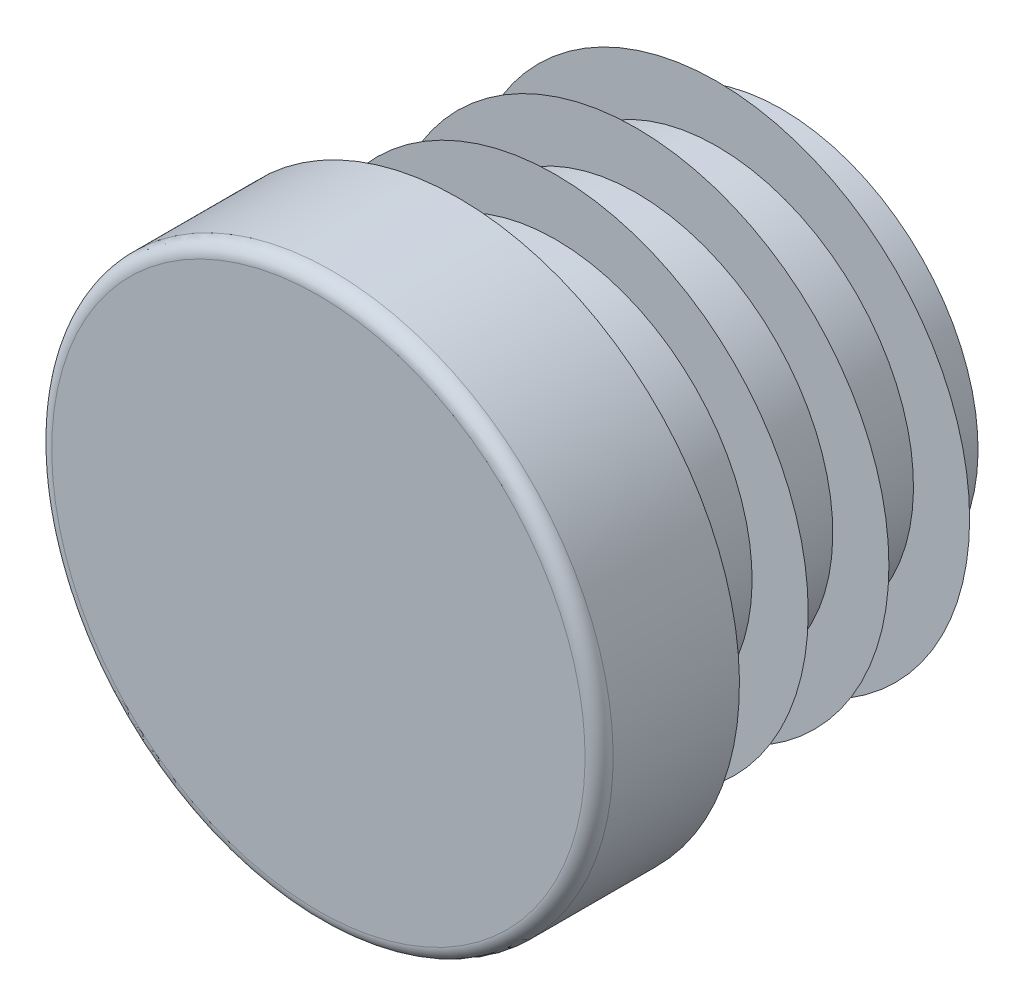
ISO-10303-21;
HEADER;
FILE_DESCRIPTION(('STEP AP214'),'2;1');
FILE_NAME('part.step','',(''),(''),'','','');
FILE_SCHEMA(('AUTOMOTIVE_DESIGN { 1 0 10303 214 1 1 1 1 }'));
ENDSEC;
DATA;
#1=APPLICATION_CONTEXT('core data for automotive mechanical design processes');
#2=APPLICATION_PROTOCOL_DEFINITION('international standard','automotive_design',2000,#1);
#3=PRODUCT_CONTEXT('',#1,'mechanical');
#4=PRODUCT('Part','Part','',(#3));
#5=PRODUCT_RELATED_PRODUCT_CATEGORY('part','',(#4));
#6=PRODUCT_DEFINITION_FORMATION('','',#4);
#7=PRODUCT_DEFINITION_CONTEXT('part definition',#1,'design');
#8=PRODUCT_DEFINITION('design','',#6,#7);
#9=PRODUCT_DEFINITION_SHAPE('','',#8);
#10=(LENGTH_UNIT() NAMED_UNIT(*) SI_UNIT(.MILLI.,.METRE.));
#11=(NAMED_UNIT(*) PLANE_ANGLE_UNIT() SI_UNIT($,.RADIAN.));
#12=(NAMED_UNIT(*) SI_UNIT($,.STERADIAN.) SOLID_ANGLE_UNIT());
#13=UNCERTAINTY_MEASURE_WITH_UNIT(LENGTH_MEASURE(1.E-05),#10,'distance_accuracy_value','');
#14=(GEOMETRIC_REPRESENTATION_CONTEXT(3) GLOBAL_UNCERTAINTY_ASSIGNED_CONTEXT((#13)) GLOBAL_UNIT_ASSIGNED_CONTEXT((#10,
#11,#12)) REPRESENTATION_CONTEXT('',''));
#15=CARTESIAN_POINT('',(0.,0.,0.));
#16=DIRECTION('',(0.,0.,1.));
#17=DIRECTION('',(1.,0.,0.));
#18=AXIS2_PLACEMENT_3D('',#15,#16,#17);
#19=CARTESIAN_POINT('',(0.,0.,5.));
#20=DIRECTION('',(0.,0.,-1.));
#21=DIRECTION('',(0.,1.,0.));
#22=AXIS2_PLACEMENT_3D('',#19,#20,#21);
#23=PLANE('',#22);
#24=CARTESIAN_POINT('',(0.,0.,5.));
#25=DIRECTION('',(0.,0.,-1.));
#26=DIRECTION('',(0.,1.,0.));
#27=AXIS2_PLACEMENT_3D('',#24,#25,#26);
#28=CIRCLE('',#27,9.5);
#29=CARTESIAN_POINT('',(0.,9.5,5.));
#30=VERTEX_POINT('',#29);
#31=EDGE_CURVE('E8',#30,#30,#28,.T.);
#32=ORIENTED_EDGE('',*,*,#31,.F.);
#33=EDGE_LOOP('',(#32));
#34=FACE_BOUND('',#33,.T.);
#35=ADVANCED_FACE('F12',(#34),#23,.F.);
#36=CARTESIAN_POINT('',(0.,0.,4.5));
#37=DIRECTION('',(0.,0.,-1.));
#38=DIRECTION('',(0.,1.,0.));
#39=AXIS2_PLACEMENT_3D('',#36,#37,#38);
#40=TOROIDAL_SURFACE('',#39,9.5,0.5);
#41=ORIENTED_EDGE('',*,*,#31,.T.);
#42=EDGE_LOOP('',(#41));
#43=FACE_BOUND('',#42,.T.);
#44=CARTESIAN_POINT('',(0.,0.,4.5));
#45=DIRECTION('',(0.,0.,-1.));
#46=DIRECTION('',(0.,1.,0.));
#47=AXIS2_PLACEMENT_3D('',#44,#45,#46);
#48=CIRCLE('',#47,10.);
#49=CARTESIAN_POINT('',(0.,10.,4.5));
#50=VERTEX_POINT('',#49);
#51=EDGE_CURVE('E18',#50,#50,#48,.T.);
#52=ORIENTED_EDGE('',*,*,#51,.F.);
#53=EDGE_LOOP('',(#52));
#54=FACE_BOUND('',#53,.T.);
#55=ADVANCED_FACE('F159',(#43,#54),#40,.T.);
#56=CARTESIAN_POINT('',(0.,0.,-11.5));
#57=DIRECTION('',(0.,0.,-1.));
#58=DIRECTION('',(0.,1.,0.));
#59=AXIS2_PLACEMENT_3D('',#56,#57,#58);
#60=CYLINDRICAL_SURFACE('',#59,10.);
#61=CARTESIAN_POINT('',(0.,0.,0.));
#62=DIRECTION('',(0.,0.,-1.));
#63=DIRECTION('',(0.,1.,0.));
#64=AXIS2_PLACEMENT_3D('',#61,#62,#63);
#65=CIRCLE('',#64,10.);
#66=CARTESIAN_POINT('',(0.,10.,0.));
#67=VERTEX_POINT('',#66);
#68=EDGE_CURVE('E22',#67,#67,#65,.T.);
#69=ORIENTED_EDGE('',*,*,#68,.F.);
#70=EDGE_LOOP('',(#69));
#71=FACE_BOUND('',#70,.T.);
#72=ORIENTED_EDGE('',*,*,#51,.T.);
#73=EDGE_LOOP('',(#72));
#74=FACE_BOUND('',#73,.T.);
#75=ADVANCED_FACE('F154',(#71,#74),#60,.T.);
#76=CARTESIAN_POINT('',(10.,0.,0.));
#77=DIRECTION('',(0.,0.,1.));
#78=DIRECTION('',(0.,-1.,0.));
#79=AXIS2_PLACEMENT_3D('',#76,#77,#78);
#80=PLANE('',#79);
#81=CARTESIAN_POINT('',(0.,0.,0.));
#82=DIRECTION('',(0.,0.,-1.));
#83=DIRECTION('',(0.,1.,0.));
#84=AXIS2_PLACEMENT_3D('',#81,#82,#83);
#85=CIRCLE('',#84,7.);
#86=CARTESIAN_POINT('',(0.,7.,0.));
#87=VERTEX_POINT('',#86);
#88=EDGE_CURVE('E26',#87,#87,#85,.T.);
#89=ORIENTED_EDGE('',*,*,#88,.F.);
#90=EDGE_LOOP('',(#89));
#91=FACE_BOUND('',#90,.T.);
#92=ORIENTED_EDGE('',*,*,#68,.T.);
#93=EDGE_LOOP('',(#92));
#94=FACE_BOUND('',#93,.T.);
#95=ADVANCED_FACE('F148',(#91,#94),#80,.F.);
#96=CARTESIAN_POINT('',(0.,0.,-11.5));
#97=DIRECTION('',(0.,0.,-1.));
#98=DIRECTION('',(0.,1.,0.));
#99=AXIS2_PLACEMENT_3D('',#96,#97,#98);
#100=CYLINDRICAL_SURFACE('',#99,7.);
#101=CARTESIAN_POINT('',(0.,0.,-0.575));
#102=DIRECTION('',(0.,0.,-1.));
#103=DIRECTION('',(0.,1.,0.));
#104=AXIS2_PLACEMENT_3D('',#101,#102,#103);
#105=CIRCLE('',#104,7.);
#106=CARTESIAN_POINT('',(0.,7.,-0.575));
#107=VERTEX_POINT('',#106);
#108=EDGE_CURVE('E31',#107,#107,#105,.T.);
#109=ORIENTED_EDGE('',*,*,#108,.F.);
#110=EDGE_LOOP('',(#109));
#111=FACE_BOUND('',#110,.T.);
#112=ORIENTED_EDGE('',*,*,#88,.T.);
#113=EDGE_LOOP('',(#112));
#114=FACE_BOUND('',#113,.T.);
#115=ADVANCED_FACE('F142',(#111,#114),#100,.T.);
#116=CARTESIAN_POINT('',(7.,0.,-0.575));
#117=DIRECTION('',(0.,0.,-1.));
#118=DIRECTION('',(0.,1.,0.));
#119=AXIS2_PLACEMENT_3D('',#116,#117,#118);
#120=PLANE('',#119);
#121=CARTESIAN_POINT('',(0.,0.,-0.575));
#122=DIRECTION('',(0.,0.,-1.));
#123=DIRECTION('',(0.,1.,0.));
#124=AXIS2_PLACEMENT_3D('',#121,#122,#123);
#125=CIRCLE('',#124,9.);
#126=CARTESIAN_POINT('',(0.,9.,-0.575));
#127=VERTEX_POINT('',#126);
#128=EDGE_CURVE('E34',#127,#127,#125,.T.);
#129=ORIENTED_EDGE('',*,*,#128,.F.);
#130=EDGE_LOOP('',(#129));
#131=FACE_BOUND('',#130,.T.);
#132=ORIENTED_EDGE('',*,*,#108,.T.);
#133=EDGE_LOOP('',(#132));
#134=FACE_BOUND('',#133,.T.);
#135=ADVANCED_FACE('F136',(#131,#134),#120,.F.);
#136=CARTESIAN_POINT('',(0.,0.,-0.575));
#137=DIRECTION('',(0.,0.,1.));
#138=DIRECTION('',(0.,-1.,0.));
#139=AXIS2_PLACEMENT_3D('',#136,#137,#138);
#140=CONICAL_SURFACE('',#139,9.,0.959931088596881);
#141=CARTESIAN_POINT('',(0.,0.,-1.97541507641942));
#142=DIRECTION('',(0.,0.,-1.));
#143=DIRECTION('',(0.,1.,0.));
#144=AXIS2_PLACEMENT_3D('',#141,#142,#143);
#145=CIRCLE('',#144,7.);
#146=CARTESIAN_POINT('',(0.,7.,-1.97541507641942));
#147=VERTEX_POINT('',#146);
#148=EDGE_CURVE('E37',#147,#147,#145,.T.);
#149=ORIENTED_EDGE('',*,*,#148,.F.);
#150=EDGE_LOOP('',(#149));
#151=FACE_BOUND('',#150,.T.);
#152=ORIENTED_EDGE('',*,*,#128,.T.);
#153=EDGE_LOOP('',(#152));
#154=FACE_BOUND('',#153,.T.);
#155=ADVANCED_FACE('F130',(#151,#154),#140,.T.);
#156=CARTESIAN_POINT('',(0.,0.,-11.5));
#157=DIRECTION('',(0.,0.,-1.));
#158=DIRECTION('',(0.,1.,0.));
#159=AXIS2_PLACEMENT_3D('',#156,#157,#158);
#160=CYLINDRICAL_SURFACE('',#159,7.);
#161=CARTESIAN_POINT('',(0.,0.,-3.45));
#162=DIRECTION('',(0.,0.,-1.));
#163=DIRECTION('',(0.,1.,0.));
#164=AXIS2_PLACEMENT_3D('',#161,#162,#163);
#165=CIRCLE('',#164,7.);
#166=CARTESIAN_POINT('',(0.,7.,-3.45));
#167=VERTEX_POINT('',#166);
#168=EDGE_CURVE('E40',#167,#167,#165,.T.);
#169=ORIENTED_EDGE('',*,*,#168,.F.);
#170=EDGE_LOOP('',(#169));
#171=FACE_BOUND('',#170,.T.);
#172=ORIENTED_EDGE('',*,*,#148,.T.);
#173=EDGE_LOOP('',(#172));
#174=FACE_BOUND('',#173,.T.);
#175=ADVANCED_FACE('F124',(#171,#174),#160,.T.);
#176=CARTESIAN_POINT('',(7.,0.,-3.45));
#177=DIRECTION('',(0.,0.,-1.));
#178=DIRECTION('',(0.,1.,0.));
#179=AXIS2_PLACEMENT_3D('',#176,#177,#178);
#180=PLANE('',#179);
#181=CARTESIAN_POINT('',(0.,0.,-3.45));
#182=DIRECTION('',(0.,0.,-1.));
#183=DIRECTION('',(0.,1.,0.));
#184=AXIS2_PLACEMENT_3D('',#181,#182,#183);
#185=CIRCLE('',#184,9.);
#186=CARTESIAN_POINT('',(0.,9.,-3.45));
#187=VERTEX_POINT('',#186);
#188=EDGE_CURVE('E43',#187,#187,#185,.T.);
#189=ORIENTED_EDGE('',*,*,#188,.F.);
#190=EDGE_LOOP('',(#189));
#191=FACE_BOUND('',#190,.T.);
#192=ORIENTED_EDGE('',*,*,#168,.T.);
#193=EDGE_LOOP('',(#192));
#194=FACE_BOUND('',#193,.T.);
#195=ADVANCED_FACE('F118',(#191,#194),#180,.F.);
#196=CARTESIAN_POINT('',(0.,0.,-3.45));
#197=DIRECTION('',(0.,0.,1.));
#198=DIRECTION('',(0.,-1.,0.));
#199=AXIS2_PLACEMENT_3D('',#196,#197,#198);
#200=CONICAL_SURFACE('',#199,9.,0.959931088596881);
#201=CARTESIAN_POINT('',(0.,0.,-4.85041507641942));
#202=DIRECTION('',(0.,0.,-1.));
#203=DIRECTION('',(0.,1.,0.));
#204=AXIS2_PLACEMENT_3D('',#201,#202,#203);
#205=CIRCLE('',#204,7.);
#206=CARTESIAN_POINT('',(0.,7.,-4.85041507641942));
#207=VERTEX_POINT('',#206);
#208=EDGE_CURVE('E46',#207,#207,#205,.T.);
#209=ORIENTED_EDGE('',*,*,#208,.F.);
#210=EDGE_LOOP('',(#209));
#211=FACE_BOUND('',#210,.T.);
#212=ORIENTED_EDGE('',*,*,#188,.T.);
#213=EDGE_LOOP('',(#212));
#214=FACE_BOUND('',#213,.T.);
#215=ADVANCED_FACE('F112',(#211,#214),#200,.T.);
#216=CARTESIAN_POINT('',(0.,0.,-11.5));
#217=DIRECTION('',(0.,0.,-1.));
#218=DIRECTION('',(0.,1.,0.));
#219=AXIS2_PLACEMENT_3D('',#216,#217,#218);
#220=CYLINDRICAL_SURFACE('',#219,7.);
#221=CARTESIAN_POINT('',(0.,0.,-6.325));
#222=DIRECTION('',(0.,0.,-1.));
#223=DIRECTION('',(0.,1.,0.));
#224=AXIS2_PLACEMENT_3D('',#221,#222,#223);
#225=CIRCLE('',#224,7.);
#226=CARTESIAN_POINT('',(0.,7.,-6.325));
#227=VERTEX_POINT('',#226);
#228=EDGE_CURVE('E49',#227,#227,#225,.T.);
#229=ORIENTED_EDGE('',*,*,#228,.F.);
#230=EDGE_LOOP('',(#229));
#231=FACE_BOUND('',#230,.T.);
#232=ORIENTED_EDGE('',*,*,#208,.T.);
#233=EDGE_LOOP('',(#232));
#234=FACE_BOUND('',#233,.T.);
#235=ADVANCED_FACE('F106',(#231,#234),#220,.T.);
#236=CARTESIAN_POINT('',(7.,0.,-6.325));
#237=DIRECTION('',(0.,0.,-1.));
#238=DIRECTION('',(0.,1.,0.));
#239=AXIS2_PLACEMENT_3D('',#236,#237,#238);
#240=PLANE('',#239);
#241=CARTESIAN_POINT('',(0.,0.,-6.325));
#242=DIRECTION('',(0.,0.,-1.));
#243=DIRECTION('',(0.,1.,0.));
#244=AXIS2_PLACEMENT_3D('',#241,#242,#243);
#245=CIRCLE('',#244,9.);
#246=CARTESIAN_POINT('',(0.,9.,-6.325));
#247=VERTEX_POINT('',#246);
#248=EDGE_CURVE('E52',#247,#247,#245,.T.);
#249=ORIENTED_EDGE('',*,*,#248,.F.);
#250=EDGE_LOOP('',(#249));
#251=FACE_BOUND('',#250,.T.);
#252=ORIENTED_EDGE('',*,*,#228,.T.);
#253=EDGE_LOOP('',(#252));
#254=FACE_BOUND('',#253,.T.);
#255=ADVANCED_FACE('F100',(#251,#254),#240,.F.);
#256=CARTESIAN_POINT('',(0.,0.,-6.325));
#257=DIRECTION('',(0.,0.,1.));
#258=DIRECTION('',(0.,-1.,0.));
#259=AXIS2_PLACEMENT_3D('',#256,#257,#258);
#260=CONICAL_SURFACE('',#259,9.,0.959931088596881);
#261=CARTESIAN_POINT('',(0.,0.,-7.72541507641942));
#262=DIRECTION('',(0.,0.,-1.));
#263=DIRECTION('',(0.,1.,0.));
#264=AXIS2_PLACEMENT_3D('',#261,#262,#263);
#265=CIRCLE('',#264,7.);
#266=CARTESIAN_POINT('',(0.,7.,-7.72541507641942));
#267=VERTEX_POINT('',#266);
#268=EDGE_CURVE('E55',#267,#267,#265,.T.);
#269=ORIENTED_EDGE('',*,*,#268,.F.);
#270=EDGE_LOOP('',(#269));
#271=FACE_BOUND('',#270,.T.);
#272=ORIENTED_EDGE('',*,*,#248,.T.);
#273=EDGE_LOOP('',(#272));
#274=FACE_BOUND('',#273,.T.);
#275=ADVANCED_FACE('F94',(#271,#274),#260,.T.);
#276=CARTESIAN_POINT('',(0.,0.,-11.5));
#277=DIRECTION('',(0.,0.,-1.));
#278=DIRECTION('',(0.,1.,0.));
#279=AXIS2_PLACEMENT_3D('',#276,#277,#278);
#280=CYLINDRICAL_SURFACE('',#279,7.);
#281=CARTESIAN_POINT('',(0.,0.,-9.2));
#282=DIRECTION('',(0.,0.,-1.));
#283=DIRECTION('',(0.,1.,0.));
#284=AXIS2_PLACEMENT_3D('',#281,#282,#283);
#285=CIRCLE('',#284,7.);
#286=CARTESIAN_POINT('',(0.,7.,-9.2));
#287=VERTEX_POINT('',#286);
#288=EDGE_CURVE('E58',#287,#287,#285,.T.);
#289=ORIENTED_EDGE('',*,*,#288,.F.);
#290=EDGE_LOOP('',(#289));
#291=FACE_BOUND('',#290,.T.);
#292=ORIENTED_EDGE('',*,*,#268,.T.);
#293=EDGE_LOOP('',(#292));
#294=FACE_BOUND('',#293,.T.);
#295=ADVANCED_FACE('F88',(#291,#294),#280,.T.);
#296=CARTESIAN_POINT('',(7.,0.,-9.2));
#297=DIRECTION('',(0.,0.,-1.));
#298=DIRECTION('',(0.,1.,0.));
#299=AXIS2_PLACEMENT_3D('',#296,#297,#298);
#300=PLANE('',#299);
#301=CARTESIAN_POINT('',(0.,0.,-9.2));
#302=DIRECTION('',(0.,0.,-1.));
#303=DIRECTION('',(0.,1.,0.));
#304=AXIS2_PLACEMENT_3D('',#301,#302,#303);
#305=CIRCLE('',#304,9.);
#306=CARTESIAN_POINT('',(0.,9.,-9.2));
#307=VERTEX_POINT('',#306);
#308=EDGE_CURVE('E61',#307,#307,#305,.T.);
#309=ORIENTED_EDGE('',*,*,#308,.F.);
#310=EDGE_LOOP('',(#309));
#311=FACE_BOUND('',#310,.T.);
#312=ORIENTED_EDGE('',*,*,#288,.T.);
#313=EDGE_LOOP('',(#312));
#314=FACE_BOUND('',#313,.T.);
#315=ADVANCED_FACE('F82',(#311,#314),#300,.F.);
#316=CARTESIAN_POINT('',(0.,0.,-9.2));
#317=DIRECTION('',(0.,0.,1.));
#318=DIRECTION('',(0.,-1.,0.));
#319=AXIS2_PLACEMENT_3D('',#316,#317,#318);
#320=CONICAL_SURFACE('',#319,9.,0.959931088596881);
#321=CARTESIAN_POINT('',(0.,0.,-10.6004150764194));
#322=DIRECTION('',(0.,0.,-1.));
#323=DIRECTION('',(0.,1.,0.));
#324=AXIS2_PLACEMENT_3D('',#321,#322,#323);
#325=CIRCLE('',#324,7.);
#326=CARTESIAN_POINT('',(0.,7.,-10.6004150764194));
#327=VERTEX_POINT('',#326);
#328=EDGE_CURVE('E64',#327,#327,#325,.T.);
#329=ORIENTED_EDGE('',*,*,#328,.F.);
#330=EDGE_LOOP('',(#329));
#331=FACE_BOUND('',#330,.T.);
#332=ORIENTED_EDGE('',*,*,#308,.T.);
#333=EDGE_LOOP('',(#332));
#334=FACE_BOUND('',#333,.T.);
#335=ADVANCED_FACE('F76',(#331,#334),#320,.T.);
#336=CARTESIAN_POINT('',(0.,0.,-11.5));
#337=DIRECTION('',(0.,0.,-1.));
#338=DIRECTION('',(0.,1.,0.));
#339=AXIS2_PLACEMENT_3D('',#336,#337,#338);
#340=CYLINDRICAL_SURFACE('',#339,7.);
#341=CARTESIAN_POINT('',(0.,0.,-11.5));
#342=DIRECTION('',(0.,0.,-1.));
#343=DIRECTION('',(0.,1.,0.));
#344=AXIS2_PLACEMENT_3D('',#341,#342,#343);
#345=CIRCLE('',#344,7.);
#346=CARTESIAN_POINT('',(0.,7.,-11.5));
#347=VERTEX_POINT('',#346);
#348=EDGE_CURVE('E67',#347,#347,#345,.T.);
#349=ORIENTED_EDGE('',*,*,#348,.F.);
#350=EDGE_LOOP('',(#349));
#351=FACE_BOUND('',#350,.T.);
#352=ORIENTED_EDGE('',*,*,#328,.T.);
#353=EDGE_LOOP('',(#352));
#354=FACE_BOUND('',#353,.T.);
#355=ADVANCED_FACE('F73',(#351,#354),#340,.T.);
#356=CARTESIAN_POINT('',(7.,0.,-11.5));
#357=DIRECTION('',(0.,0.,1.));
#358=DIRECTION('',(0.,-1.,0.));
#359=AXIS2_PLACEMENT_3D('',#356,#357,#358);
#360=PLANE('',#359);
#361=ORIENTED_EDGE('',*,*,#348,.T.);
#362=EDGE_LOOP('',(#361));
#363=FACE_BOUND('',#362,.T.);
#364=ADVANCED_FACE('F71',(#363),#360,.F.);
#365=CLOSED_SHELL('',(#35,#55,#75,#95,#115,#135,#155,#175,#195,#215,#235,#255,#275,#295,#315,
#335,#355,#364));
#366=MANIFOLD_SOLID_BREP('B1',#365);
#367=ADVANCED_BREP_SHAPE_REPRESENTATION('',(#18,#366),#14);
#368=SHAPE_DEFINITION_REPRESENTATION(#9,#367);
ENDSEC;
END-ISO-10303-21;
